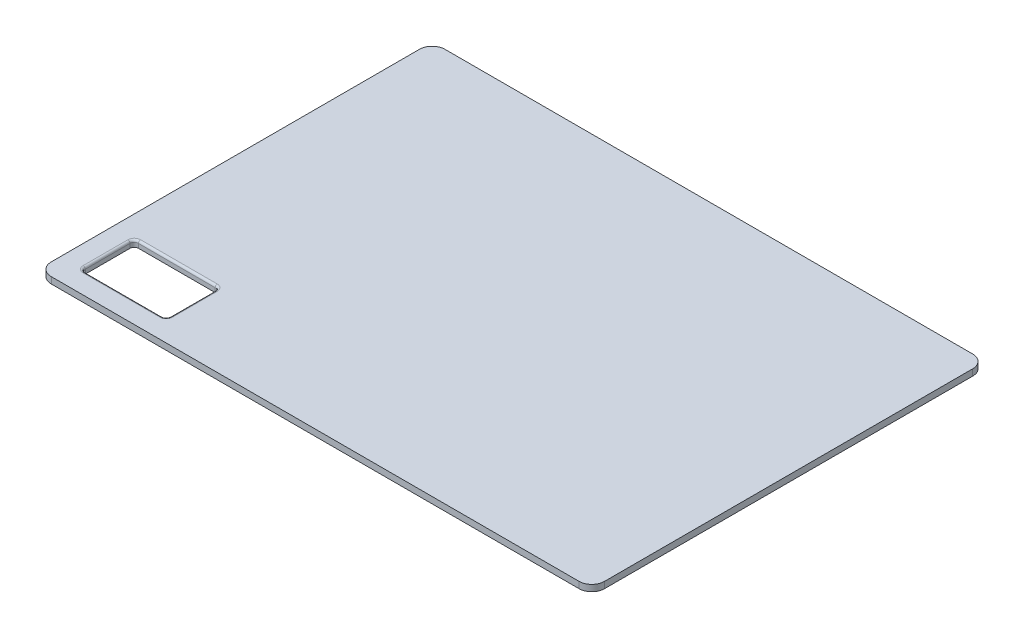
ISO-10303-21;
HEADER;
FILE_DESCRIPTION(('STEP AP214'),'2;1');
FILE_NAME('part.step','',(''),(''),'','','');
FILE_SCHEMA(('AUTOMOTIVE_DESIGN { 1 0 10303 214 1 1 1 1 }'));
ENDSEC;
DATA;
#1=APPLICATION_CONTEXT('core data for automotive mechanical design processes');
#2=APPLICATION_PROTOCOL_DEFINITION('international standard','automotive_design',2000,#1);
#3=PRODUCT_CONTEXT('',#1,'mechanical');
#4=PRODUCT('Part','Part','',(#3));
#5=PRODUCT_RELATED_PRODUCT_CATEGORY('part','',(#4));
#6=PRODUCT_DEFINITION_FORMATION('','',#4);
#7=PRODUCT_DEFINITION_CONTEXT('part definition',#1,'design');
#8=PRODUCT_DEFINITION('design','',#6,#7);
#9=PRODUCT_DEFINITION_SHAPE('','',#8);
#10=(LENGTH_UNIT() NAMED_UNIT(*) SI_UNIT(.MILLI.,.METRE.));
#11=(NAMED_UNIT(*) PLANE_ANGLE_UNIT() SI_UNIT($,.RADIAN.));
#12=(NAMED_UNIT(*) SI_UNIT($,.STERADIAN.) SOLID_ANGLE_UNIT());
#13=UNCERTAINTY_MEASURE_WITH_UNIT(LENGTH_MEASURE(1.E-05),#10,'distance_accuracy_value','');
#14=(GEOMETRIC_REPRESENTATION_CONTEXT(3) GLOBAL_UNCERTAINTY_ASSIGNED_CONTEXT((#13)) GLOBAL_UNIT_ASSIGNED_CONTEXT((#10,
#11,#12)) REPRESENTATION_CONTEXT('',''));
#15=CARTESIAN_POINT('',(0.,0.,0.));
#16=DIRECTION('',(0.,0.,1.));
#17=DIRECTION('',(1.,0.,0.));
#18=AXIS2_PLACEMENT_3D('',#15,#16,#17);
#19=CARTESIAN_POINT('',(0.,3.,0.));
#20=DIRECTION('',(1.,0.,0.));
#21=DIRECTION('',(0.,0.,-1.));
#22=AXIS2_PLACEMENT_3D('',#19,#20,#21);
#23=PLANE('',#22);
#24=DIRECTION('',(0.,0.,1.));
#25=VECTOR('',#24,1.);
#26=CARTESIAN_POINT('',(0.,3.,0.));
#27=LINE('',#26,#25);
#28=CARTESIAN_POINT('',(0.,3.,-179.));
#29=VERTEX_POINT('',#28);
#30=CARTESIAN_POINT('',(0.,3.,-6.));
#31=VERTEX_POINT('',#30);
#32=EDGE_CURVE('E197',#29,#31,#27,.T.);
#33=ORIENTED_EDGE('',*,*,#32,.F.);
#34=DIRECTION('',(0.,-1.,0.));
#35=VECTOR('',#34,1.);
#36=CARTESIAN_POINT('',(0.,3.,-179.));
#37=LINE('',#36,#35);
#38=CARTESIAN_POINT('',(0.,0.,-179.));
#39=VERTEX_POINT('',#38);
#40=EDGE_CURVE('E182',#29,#39,#37,.T.);
#41=ORIENTED_EDGE('',*,*,#40,.T.);
#42=DIRECTION('',(0.,0.,1.));
#43=VECTOR('',#42,1.);
#44=CARTESIAN_POINT('',(0.,0.,0.));
#45=LINE('',#44,#43);
#46=CARTESIAN_POINT('',(0.,0.,-6.));
#47=VERTEX_POINT('',#46);
#48=EDGE_CURVE('E193',#39,#47,#45,.T.);
#49=ORIENTED_EDGE('',*,*,#48,.T.);
#50=DIRECTION('',(0.,-1.,0.));
#51=VECTOR('',#50,1.);
#52=CARTESIAN_POINT('',(0.,3.,-6.));
#53=LINE('',#52,#51);
#54=EDGE_CURVE('E199',#47,#31,#53,.F.);
#55=ORIENTED_EDGE('',*,*,#54,.T.);
#56=EDGE_LOOP('',(#33,#41,#49,#55));
#57=FACE_BOUND('',#56,.T.);
#58=ADVANCED_FACE('F41',(#57),#23,.F.);
#59=CARTESIAN_POINT('',(0.,3.,0.));
#60=DIRECTION('',(0.,0.,-1.));
#61=DIRECTION('',(-1.,0.,0.));
#62=AXIS2_PLACEMENT_3D('',#59,#60,#61);
#63=PLANE('',#62);
#64=DIRECTION('',(1.,0.,0.));
#65=VECTOR('',#64,1.);
#66=CARTESIAN_POINT('',(0.,0.,0.));
#67=LINE('',#66,#65);
#68=CARTESIAN_POINT('',(6.,0.,0.));
#69=VERTEX_POINT('',#68);
#70=CARTESIAN_POINT('',(254.,0.,0.));
#71=VERTEX_POINT('',#70);
#72=EDGE_CURVE('E204',#69,#71,#67,.T.);
#73=ORIENTED_EDGE('',*,*,#72,.T.);
#74=DIRECTION('',(0.,-1.,0.));
#75=VECTOR('',#74,1.);
#76=CARTESIAN_POINT('',(254.,3.,0.));
#77=LINE('',#76,#75);
#78=CARTESIAN_POINT('',(254.,3.,0.));
#79=VERTEX_POINT('',#78);
#80=EDGE_CURVE('E244',#71,#79,#77,.F.);
#81=ORIENTED_EDGE('',*,*,#80,.T.);
#82=DIRECTION('',(1.,0.,0.));
#83=VECTOR('',#82,1.);
#84=CARTESIAN_POINT('',(0.,3.,0.));
#85=LINE('',#84,#83);
#86=CARTESIAN_POINT('',(6.,3.,0.));
#87=VERTEX_POINT('',#86);
#88=EDGE_CURVE('E345',#87,#79,#85,.T.);
#89=ORIENTED_EDGE('',*,*,#88,.F.);
#90=DIRECTION('',(0.,-1.,0.));
#91=VECTOR('',#90,1.);
#92=CARTESIAN_POINT('',(6.,3.,0.));
#93=LINE('',#92,#91);
#94=EDGE_CURVE('E245',#87,#69,#93,.T.);
#95=ORIENTED_EDGE('',*,*,#94,.T.);
#96=EDGE_LOOP('',(#73,#81,#89,#95));
#97=FACE_BOUND('',#96,.T.);
#98=ADVANCED_FACE('F368',(#97),#63,.F.);
#99=CARTESIAN_POINT('',(260.,3.,0.));
#100=DIRECTION('',(-1.,0.,0.));
#101=DIRECTION('',(0.,0.,1.));
#102=AXIS2_PLACEMENT_3D('',#99,#100,#101);
#103=PLANE('',#102);
#104=DIRECTION('',(0.,0.,-1.));
#105=VECTOR('',#104,1.);
#106=CARTESIAN_POINT('',(260.,0.,0.));
#107=LINE('',#106,#105);
#108=CARTESIAN_POINT('',(260.,0.,-6.));
#109=VERTEX_POINT('',#108);
#110=CARTESIAN_POINT('',(260.,0.,-179.));
#111=VERTEX_POINT('',#110);
#112=EDGE_CURVE('E206',#109,#111,#107,.T.);
#113=ORIENTED_EDGE('',*,*,#112,.T.);
#114=DIRECTION('',(0.,-1.,0.));
#115=VECTOR('',#114,1.);
#116=CARTESIAN_POINT('',(260.,3.,-179.));
#117=LINE('',#116,#115);
#118=CARTESIAN_POINT('',(260.,3.,-179.));
#119=VERTEX_POINT('',#118);
#120=EDGE_CURVE('E239',#111,#119,#117,.F.);
#121=ORIENTED_EDGE('',*,*,#120,.T.);
#122=DIRECTION('',(0.,0.,-1.));
#123=VECTOR('',#122,1.);
#124=CARTESIAN_POINT('',(260.,3.,0.));
#125=LINE('',#124,#123);
#126=CARTESIAN_POINT('',(260.,3.,-6.));
#127=VERTEX_POINT('',#126);
#128=EDGE_CURVE('E343',#127,#119,#125,.T.);
#129=ORIENTED_EDGE('',*,*,#128,.F.);
#130=DIRECTION('',(0.,-1.,0.));
#131=VECTOR('',#130,1.);
#132=CARTESIAN_POINT('',(260.,3.,-6.));
#133=LINE('',#132,#131);
#134=EDGE_CURVE('E240',#127,#109,#133,.T.);
#135=ORIENTED_EDGE('',*,*,#134,.T.);
#136=EDGE_LOOP('',(#113,#121,#129,#135));
#137=FACE_BOUND('',#136,.T.);
#138=ADVANCED_FACE('F363',(#137),#103,.F.);
#139=CARTESIAN_POINT('',(0.,3.,-185.));
#140=DIRECTION('',(0.,0.,1.));
#141=DIRECTION('',(1.,0.,0.));
#142=AXIS2_PLACEMENT_3D('',#139,#140,#141);
#143=PLANE('',#142);
#144=DIRECTION('',(-1.,0.,0.));
#145=VECTOR('',#144,1.);
#146=CARTESIAN_POINT('',(0.,0.,-185.));
#147=LINE('',#146,#145);
#148=CARTESIAN_POINT('',(254.,0.,-185.));
#149=VERTEX_POINT('',#148);
#150=CARTESIAN_POINT('',(6.,0.,-185.));
#151=VERTEX_POINT('',#150);
#152=EDGE_CURVE('E218',#149,#151,#147,.T.);
#153=ORIENTED_EDGE('',*,*,#152,.T.);
#154=DIRECTION('',(0.,-1.,0.));
#155=VECTOR('',#154,1.);
#156=CARTESIAN_POINT('',(6.,3.,-185.));
#157=LINE('',#156,#155);
#158=CARTESIAN_POINT('',(6.,3.,-185.));
#159=VERTEX_POINT('',#158);
#160=EDGE_CURVE('E183',#151,#159,#157,.F.);
#161=ORIENTED_EDGE('',*,*,#160,.T.);
#162=DIRECTION('',(-1.,0.,0.));
#163=VECTOR('',#162,1.);
#164=CARTESIAN_POINT('',(0.,3.,-185.));
#165=LINE('',#164,#163);
#166=CARTESIAN_POINT('',(254.,3.,-185.));
#167=VERTEX_POINT('',#166);
#168=EDGE_CURVE('E211',#167,#159,#165,.T.);
#169=ORIENTED_EDGE('',*,*,#168,.F.);
#170=DIRECTION('',(0.,-1.,0.));
#171=VECTOR('',#170,1.);
#172=CARTESIAN_POINT('',(254.,3.,-185.));
#173=LINE('',#172,#171);
#174=EDGE_CURVE('E186',#167,#149,#173,.T.);
#175=ORIENTED_EDGE('',*,*,#174,.T.);
#176=EDGE_LOOP('',(#153,#161,#169,#175));
#177=FACE_BOUND('',#176,.T.);
#178=ADVANCED_FACE('F353',(#177),#143,.F.);
#179=CARTESIAN_POINT('',(0.,3.,-185.));
#180=DIRECTION('',(0.,-1.,0.));
#181=DIRECTION('',(0.,0.,-1.));
#182=AXIS2_PLACEMENT_3D('',#179,#180,#181);
#183=PLANE('',#182);
#184=DIRECTION('',(1.,0.,0.));
#185=VECTOR('',#184,1.);
#186=CARTESIAN_POINT('',(0.,3.,-9.00000000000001));
#187=LINE('',#186,#185);
#188=CARTESIAN_POINT('',(48.,3.,-9.00000000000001));
#189=VERTEX_POINT('',#188);
#190=CARTESIAN_POINT('',(12.,3.,-9.));
#191=VERTEX_POINT('',#190);
#192=EDGE_CURVE('E271',#189,#191,#187,.F.);
#193=ORIENTED_EDGE('',*,*,#192,.T.);
#194=CARTESIAN_POINT('',(12.,3.,-12.));
#195=DIRECTION('',(0.,-1.,0.));
#196=DIRECTION('',(0.,0.,-1.));
#197=AXIS2_PLACEMENT_3D('',#194,#195,#196);
#198=CIRCLE('',#197,3.);
#199=CARTESIAN_POINT('',(9.,3.,-12.));
#200=VERTEX_POINT('',#199);
#201=EDGE_CURVE('E290',#191,#200,#198,.T.);
#202=ORIENTED_EDGE('',*,*,#201,.T.);
#203=DIRECTION('',(0.,0.,1.));
#204=VECTOR('',#203,1.);
#205=CARTESIAN_POINT('',(8.99999999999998,3.,-185.));
#206=LINE('',#205,#204);
#207=CARTESIAN_POINT('',(9.,3.,-33.));
#208=VERTEX_POINT('',#207);
#209=EDGE_CURVE('E284',#200,#208,#206,.F.);
#210=ORIENTED_EDGE('',*,*,#209,.T.);
#211=CARTESIAN_POINT('',(12.,3.,-33.));
#212=DIRECTION('',(0.,-1.,0.));
#213=DIRECTION('',(0.,0.,-1.));
#214=AXIS2_PLACEMENT_3D('',#211,#212,#213);
#215=CIRCLE('',#214,3.);
#216=CARTESIAN_POINT('',(12.,3.,-36.));
#217=VERTEX_POINT('',#216);
#218=EDGE_CURVE('E282',#208,#217,#215,.T.);
#219=ORIENTED_EDGE('',*,*,#218,.T.);
#220=DIRECTION('',(-1.,0.,0.));
#221=VECTOR('',#220,1.);
#222=CARTESIAN_POINT('',(0.,3.,-36.));
#223=LINE('',#222,#221);
#224=CARTESIAN_POINT('',(48.,3.,-36.));
#225=VERTEX_POINT('',#224);
#226=EDGE_CURVE('E281',#217,#225,#223,.F.);
#227=ORIENTED_EDGE('',*,*,#226,.T.);
#228=CARTESIAN_POINT('',(48.,3.,-33.));
#229=DIRECTION('',(0.,-1.,0.));
#230=DIRECTION('',(0.,0.,-1.));
#231=AXIS2_PLACEMENT_3D('',#228,#229,#230);
#232=CIRCLE('',#231,3.);
#233=CARTESIAN_POINT('',(51.,3.,-33.));
#234=VERTEX_POINT('',#233);
#235=EDGE_CURVE('E276',#225,#234,#232,.T.);
#236=ORIENTED_EDGE('',*,*,#235,.T.);
#237=DIRECTION('',(0.,0.,-1.));
#238=VECTOR('',#237,1.);
#239=CARTESIAN_POINT('',(51.,3.,-185.));
#240=LINE('',#239,#238);
#241=CARTESIAN_POINT('',(51.,3.,-12.));
#242=VERTEX_POINT('',#241);
#243=EDGE_CURVE('E279',#234,#242,#240,.F.);
#244=ORIENTED_EDGE('',*,*,#243,.T.);
#245=CARTESIAN_POINT('',(48.,3.,-12.));
#246=DIRECTION('',(0.,-1.,0.));
#247=DIRECTION('',(0.,0.,-1.));
#248=AXIS2_PLACEMENT_3D('',#245,#246,#247);
#249=CIRCLE('',#248,3.);
#250=EDGE_CURVE('E273',#242,#189,#249,.T.);
#251=ORIENTED_EDGE('',*,*,#250,.T.);
#252=EDGE_LOOP('',(#193,#202,#210,#219,#227,#236,#244,#251));
#253=FACE_BOUND('',#252,.T.);
#254=ORIENTED_EDGE('',*,*,#168,.T.);
#255=CARTESIAN_POINT('',(6.,3.,-179.));
#256=DIRECTION('',(0.,-1.,0.));
#257=DIRECTION('',(0.,0.,-1.));
#258=AXIS2_PLACEMENT_3D('',#255,#256,#257);
#259=CIRCLE('',#258,6.);
#260=EDGE_CURVE('E232',#159,#29,#259,.F.);
#261=ORIENTED_EDGE('',*,*,#260,.T.);
#262=ORIENTED_EDGE('',*,*,#32,.T.);
#263=CARTESIAN_POINT('',(6.,3.,-6.));
#264=DIRECTION('',(0.,-1.,0.));
#265=DIRECTION('',(0.,0.,-1.));
#266=AXIS2_PLACEMENT_3D('',#263,#264,#265);
#267=CIRCLE('',#266,6.);
#268=EDGE_CURVE('E230',#31,#87,#267,.F.);
#269=ORIENTED_EDGE('',*,*,#268,.T.);
#270=ORIENTED_EDGE('',*,*,#88,.T.);
#271=CARTESIAN_POINT('',(254.,3.,-6.));
#272=DIRECTION('',(0.,-1.,0.));
#273=DIRECTION('',(0.,0.,-1.));
#274=AXIS2_PLACEMENT_3D('',#271,#272,#273);
#275=CIRCLE('',#274,6.);
#276=EDGE_CURVE('E233',#79,#127,#275,.F.);
#277=ORIENTED_EDGE('',*,*,#276,.T.);
#278=ORIENTED_EDGE('',*,*,#128,.T.);
#279=CARTESIAN_POINT('',(254.,3.,-179.));
#280=DIRECTION('',(0.,-1.,0.));
#281=DIRECTION('',(0.,0.,-1.));
#282=AXIS2_PLACEMENT_3D('',#279,#280,#281);
#283=CIRCLE('',#282,6.);
#284=EDGE_CURVE('E231',#119,#167,#283,.F.);
#285=ORIENTED_EDGE('',*,*,#284,.T.);
#286=EDGE_LOOP('',(#254,#261,#262,#269,#270,#277,#278,#285));
#287=FACE_BOUND('',#286,.T.);
#288=ADVANCED_FACE('F355',(#253,#287),#183,.F.);
#289=CARTESIAN_POINT('',(0.,0.,-185.));
#290=DIRECTION('',(0.,-1.,0.));
#291=DIRECTION('',(0.,0.,-1.));
#292=AXIS2_PLACEMENT_3D('',#289,#290,#291);
#293=PLANE('',#292);
#294=DIRECTION('',(-1.,0.,0.));
#295=VECTOR('',#294,1.);
#296=CARTESIAN_POINT('',(10.,0.,-35.));
#297=LINE('',#296,#295);
#298=CARTESIAN_POINT('',(48.,0.,-35.));
#299=VERTEX_POINT('',#298);
#300=CARTESIAN_POINT('',(12.,0.,-35.));
#301=VERTEX_POINT('',#300);
#302=EDGE_CURVE('E201',#299,#301,#297,.T.);
#303=ORIENTED_EDGE('',*,*,#302,.T.);
#304=CARTESIAN_POINT('',(12.,0.,-33.));
#305=DIRECTION('',(0.,-1.,0.));
#306=DIRECTION('',(0.,0.,-1.));
#307=AXIS2_PLACEMENT_3D('',#304,#305,#306);
#308=CIRCLE('',#307,2.);
#309=CARTESIAN_POINT('',(10.,0.,-33.));
#310=VERTEX_POINT('',#309);
#311=EDGE_CURVE('E272',#301,#310,#308,.F.);
#312=ORIENTED_EDGE('',*,*,#311,.T.);
#313=DIRECTION('',(0.,0.,1.));
#314=VECTOR('',#313,1.);
#315=CARTESIAN_POINT('',(10.,0.,-10.));
#316=LINE('',#315,#314);
#317=CARTESIAN_POINT('',(10.,0.,-12.));
#318=VERTEX_POINT('',#317);
#319=EDGE_CURVE('E326',#310,#318,#316,.T.);
#320=ORIENTED_EDGE('',*,*,#319,.T.);
#321=CARTESIAN_POINT('',(12.,0.,-12.));
#322=DIRECTION('',(0.,-1.,0.));
#323=DIRECTION('',(0.,0.,-1.));
#324=AXIS2_PLACEMENT_3D('',#321,#322,#323);
#325=CIRCLE('',#324,2.);
#326=CARTESIAN_POINT('',(12.,0.,-10.));
#327=VERTEX_POINT('',#326);
#328=EDGE_CURVE('E269',#318,#327,#325,.F.);
#329=ORIENTED_EDGE('',*,*,#328,.T.);
#330=DIRECTION('',(1.,0.,0.));
#331=VECTOR('',#330,1.);
#332=CARTESIAN_POINT('',(10.,0.,-10.));
#333=LINE('',#332,#331);
#334=CARTESIAN_POINT('',(48.,0.,-10.));
#335=VERTEX_POINT('',#334);
#336=EDGE_CURVE('E335',#327,#335,#333,.T.);
#337=ORIENTED_EDGE('',*,*,#336,.T.);
#338=CARTESIAN_POINT('',(48.,0.,-12.));
#339=DIRECTION('',(0.,-1.,0.));
#340=DIRECTION('',(0.,0.,-1.));
#341=AXIS2_PLACEMENT_3D('',#338,#339,#340);
#342=CIRCLE('',#341,2.);
#343=CARTESIAN_POINT('',(50.,0.,-12.));
#344=VERTEX_POINT('',#343);
#345=EDGE_CURVE('E270',#335,#344,#342,.F.);
#346=ORIENTED_EDGE('',*,*,#345,.T.);
#347=DIRECTION('',(0.,0.,-1.));
#348=VECTOR('',#347,1.);
#349=CARTESIAN_POINT('',(50.,0.,-10.));
#350=LINE('',#349,#348);
#351=CARTESIAN_POINT('',(50.,0.,-33.));
#352=VERTEX_POINT('',#351);
#353=EDGE_CURVE('E212',#344,#352,#350,.T.);
#354=ORIENTED_EDGE('',*,*,#353,.T.);
#355=CARTESIAN_POINT('',(48.,0.,-33.));
#356=DIRECTION('',(0.,-1.,0.));
#357=DIRECTION('',(0.,0.,-1.));
#358=AXIS2_PLACEMENT_3D('',#355,#356,#357);
#359=CIRCLE('',#358,2.);
#360=EDGE_CURVE('E264',#352,#299,#359,.F.);
#361=ORIENTED_EDGE('',*,*,#360,.T.);
#362=EDGE_LOOP('',(#303,#312,#320,#329,#337,#346,#354,#361));
#363=FACE_BOUND('',#362,.T.);
#364=ORIENTED_EDGE('',*,*,#48,.F.);
#365=CARTESIAN_POINT('',(6.,0.,-179.));
#366=DIRECTION('',(0.,-1.,0.));
#367=DIRECTION('',(0.,0.,-1.));
#368=AXIS2_PLACEMENT_3D('',#365,#366,#367);
#369=CIRCLE('',#368,6.);
#370=EDGE_CURVE('E177',#39,#151,#369,.T.);
#371=ORIENTED_EDGE('',*,*,#370,.T.);
#372=ORIENTED_EDGE('',*,*,#152,.F.);
#373=CARTESIAN_POINT('',(254.,0.,-179.));
#374=DIRECTION('',(0.,-1.,0.));
#375=DIRECTION('',(0.,0.,-1.));
#376=AXIS2_PLACEMENT_3D('',#373,#374,#375);
#377=CIRCLE('',#376,6.);
#378=EDGE_CURVE('E188',#149,#111,#377,.T.);
#379=ORIENTED_EDGE('',*,*,#378,.T.);
#380=ORIENTED_EDGE('',*,*,#112,.F.);
#381=CARTESIAN_POINT('',(254.,0.,-6.));
#382=DIRECTION('',(0.,-1.,0.));
#383=DIRECTION('',(0.,0.,-1.));
#384=AXIS2_PLACEMENT_3D('',#381,#382,#383);
#385=CIRCLE('',#384,6.);
#386=EDGE_CURVE('E224',#109,#71,#385,.T.);
#387=ORIENTED_EDGE('',*,*,#386,.T.);
#388=ORIENTED_EDGE('',*,*,#72,.F.);
#389=CARTESIAN_POINT('',(6.,0.,-6.));
#390=DIRECTION('',(0.,-1.,0.));
#391=DIRECTION('',(0.,0.,-1.));
#392=AXIS2_PLACEMENT_3D('',#389,#390,#391);
#393=CIRCLE('',#392,6.);
#394=EDGE_CURVE('E198',#69,#47,#393,.T.);
#395=ORIENTED_EDGE('',*,*,#394,.T.);
#396=EDGE_LOOP('',(#364,#371,#372,#379,#380,#387,#388,#395));
#397=FACE_BOUND('',#396,.T.);
#398=ADVANCED_FACE('F205',(#363,#397),#293,.T.);
#399=CARTESIAN_POINT('',(6.,3.,-179.));
#400=DIRECTION('',(0.,-1.,0.));
#401=DIRECTION('',(0.,0.,-1.));
#402=AXIS2_PLACEMENT_3D('',#399,#400,#401);
#403=CYLINDRICAL_SURFACE('',#402,6.);
#404=ORIENTED_EDGE('',*,*,#260,.F.);
#405=ORIENTED_EDGE('',*,*,#160,.F.);
#406=ORIENTED_EDGE('',*,*,#370,.F.);
#407=ORIENTED_EDGE('',*,*,#40,.F.);
#408=EDGE_LOOP('',(#404,#405,#406,#407));
#409=FACE_BOUND('',#408,.T.);
#410=ADVANCED_FACE('F185',(#409),#403,.T.);
#411=CARTESIAN_POINT('',(254.,3.,-179.));
#412=DIRECTION('',(0.,-1.,0.));
#413=DIRECTION('',(0.,0.,-1.));
#414=AXIS2_PLACEMENT_3D('',#411,#412,#413);
#415=CYLINDRICAL_SURFACE('',#414,6.);
#416=ORIENTED_EDGE('',*,*,#284,.F.);
#417=ORIENTED_EDGE('',*,*,#120,.F.);
#418=ORIENTED_EDGE('',*,*,#378,.F.);
#419=ORIENTED_EDGE('',*,*,#174,.F.);
#420=EDGE_LOOP('',(#416,#417,#418,#419));
#421=FACE_BOUND('',#420,.T.);
#422=ADVANCED_FACE('F357',(#421),#415,.T.);
#423=CARTESIAN_POINT('',(254.,3.,-6.));
#424=DIRECTION('',(0.,-1.,0.));
#425=DIRECTION('',(0.,0.,-1.));
#426=AXIS2_PLACEMENT_3D('',#423,#424,#425);
#427=CYLINDRICAL_SURFACE('',#426,6.);
#428=ORIENTED_EDGE('',*,*,#276,.F.);
#429=ORIENTED_EDGE('',*,*,#80,.F.);
#430=ORIENTED_EDGE('',*,*,#386,.F.);
#431=ORIENTED_EDGE('',*,*,#134,.F.);
#432=EDGE_LOOP('',(#428,#429,#430,#431));
#433=FACE_BOUND('',#432,.T.);
#434=ADVANCED_FACE('F362',(#433),#427,.T.);
#435=CARTESIAN_POINT('',(6.,3.,-6.));
#436=DIRECTION('',(0.,-1.,0.));
#437=DIRECTION('',(0.,0.,-1.));
#438=AXIS2_PLACEMENT_3D('',#435,#436,#437);
#439=CYLINDRICAL_SURFACE('',#438,6.);
#440=ORIENTED_EDGE('',*,*,#268,.F.);
#441=ORIENTED_EDGE('',*,*,#54,.F.);
#442=ORIENTED_EDGE('',*,*,#394,.F.);
#443=ORIENTED_EDGE('',*,*,#94,.F.);
#444=EDGE_LOOP('',(#440,#441,#442,#443));
#445=FACE_BOUND('',#444,.T.);
#446=ADVANCED_FACE('F373',(#445),#439,.T.);
#447=CARTESIAN_POINT('',(10.,0.,-10.));
#448=DIRECTION('',(-1.,0.,0.));
#449=DIRECTION('',(0.,0.,1.));
#450=AXIS2_PLACEMENT_3D('',#447,#448,#449);
#451=PLANE('',#450);
#452=DIRECTION('',(0.,1.,0.));
#453=VECTOR('',#452,1.);
#454=CARTESIAN_POINT('',(10.,3.,-33.));
#455=LINE('',#454,#453);
#456=CARTESIAN_POINT('',(10.,2.,-33.));
#457=VERTEX_POINT('',#456);
#458=EDGE_CURVE('E258',#310,#457,#455,.T.);
#459=ORIENTED_EDGE('',*,*,#458,.T.);
#460=DIRECTION('',(0.,0.,1.));
#461=VECTOR('',#460,1.);
#462=CARTESIAN_POINT('',(10.,2.,-10.));
#463=LINE('',#462,#461);
#464=CARTESIAN_POINT('',(10.,2.,-12.));
#465=VERTEX_POINT('',#464);
#466=EDGE_CURVE('E291',#457,#465,#463,.T.);
#467=ORIENTED_EDGE('',*,*,#466,.T.);
#468=DIRECTION('',(0.,1.,0.));
#469=VECTOR('',#468,1.);
#470=CARTESIAN_POINT('',(10.,0.,-12.));
#471=LINE('',#470,#469);
#472=EDGE_CURVE('E262',#465,#318,#471,.F.);
#473=ORIENTED_EDGE('',*,*,#472,.T.);
#474=ORIENTED_EDGE('',*,*,#319,.F.);
#475=EDGE_LOOP('',(#459,#467,#473,#474));
#476=FACE_BOUND('',#475,.T.);
#477=ADVANCED_FACE('F374',(#476),#451,.F.);
#478=CARTESIAN_POINT('',(10.,0.,-35.));
#479=DIRECTION('',(0.,0.,-1.));
#480=DIRECTION('',(-1.,0.,0.));
#481=AXIS2_PLACEMENT_3D('',#478,#479,#480);
#482=PLANE('',#481);
#483=DIRECTION('',(0.,1.,0.));
#484=VECTOR('',#483,1.);
#485=CARTESIAN_POINT('',(48.,3.,-35.));
#486=LINE('',#485,#484);
#487=CARTESIAN_POINT('',(48.,2.,-35.));
#488=VERTEX_POINT('',#487);
#489=EDGE_CURVE('E248',#299,#488,#486,.T.);
#490=ORIENTED_EDGE('',*,*,#489,.T.);
#491=DIRECTION('',(-1.,0.,0.));
#492=VECTOR('',#491,1.);
#493=CARTESIAN_POINT('',(10.,2.,-35.));
#494=LINE('',#493,#492);
#495=CARTESIAN_POINT('',(12.,2.,-35.));
#496=VERTEX_POINT('',#495);
#497=EDGE_CURVE('E300',#488,#496,#494,.T.);
#498=ORIENTED_EDGE('',*,*,#497,.T.);
#499=DIRECTION('',(0.,1.,0.));
#500=VECTOR('',#499,1.);
#501=CARTESIAN_POINT('',(12.,0.,-35.));
#502=LINE('',#501,#500);
#503=EDGE_CURVE('E250',#496,#301,#502,.F.);
#504=ORIENTED_EDGE('',*,*,#503,.T.);
#505=ORIENTED_EDGE('',*,*,#302,.F.);
#506=EDGE_LOOP('',(#490,#498,#504,#505));
#507=FACE_BOUND('',#506,.T.);
#508=ADVANCED_FACE('F385',(#507),#482,.F.);
#509=CARTESIAN_POINT('',(50.,0.,-10.));
#510=DIRECTION('',(1.,0.,0.));
#511=DIRECTION('',(0.,0.,-1.));
#512=AXIS2_PLACEMENT_3D('',#509,#510,#511);
#513=PLANE('',#512);
#514=DIRECTION('',(0.,1.,0.));
#515=VECTOR('',#514,1.);
#516=CARTESIAN_POINT('',(50.,3.,-12.));
#517=LINE('',#516,#515);
#518=CARTESIAN_POINT('',(50.,2.,-12.));
#519=VERTEX_POINT('',#518);
#520=EDGE_CURVE('E255',#344,#519,#517,.T.);
#521=ORIENTED_EDGE('',*,*,#520,.T.);
#522=DIRECTION('',(0.,0.,-1.));
#523=VECTOR('',#522,1.);
#524=CARTESIAN_POINT('',(50.,2.,-10.));
#525=LINE('',#524,#523);
#526=CARTESIAN_POINT('',(50.,2.,-33.));
#527=VERTEX_POINT('',#526);
#528=EDGE_CURVE('E301',#519,#527,#525,.T.);
#529=ORIENTED_EDGE('',*,*,#528,.T.);
#530=DIRECTION('',(0.,1.,0.));
#531=VECTOR('',#530,1.);
#532=CARTESIAN_POINT('',(50.,0.,-33.));
#533=LINE('',#532,#531);
#534=EDGE_CURVE('E251',#527,#352,#533,.F.);
#535=ORIENTED_EDGE('',*,*,#534,.T.);
#536=ORIENTED_EDGE('',*,*,#353,.F.);
#537=EDGE_LOOP('',(#521,#529,#535,#536));
#538=FACE_BOUND('',#537,.T.);
#539=ADVANCED_FACE('F423',(#538),#513,.F.);
#540=CARTESIAN_POINT('',(10.,0.,-10.));
#541=DIRECTION('',(0.,0.,1.));
#542=DIRECTION('',(1.,0.,0.));
#543=AXIS2_PLACEMENT_3D('',#540,#541,#542);
#544=PLANE('',#543);
#545=DIRECTION('',(0.,1.,0.));
#546=VECTOR('',#545,1.);
#547=CARTESIAN_POINT('',(12.,3.,-10.));
#548=LINE('',#547,#546);
#549=CARTESIAN_POINT('',(12.,2.,-10.));
#550=VERTEX_POINT('',#549);
#551=EDGE_CURVE('E257',#327,#550,#548,.T.);
#552=ORIENTED_EDGE('',*,*,#551,.T.);
#553=DIRECTION('',(1.,0.,0.));
#554=VECTOR('',#553,1.);
#555=CARTESIAN_POINT('',(10.,2.,-10.));
#556=LINE('',#555,#554);
#557=CARTESIAN_POINT('',(48.,2.,-10.));
#558=VERTEX_POINT('',#557);
#559=EDGE_CURVE('E11',#550,#558,#556,.T.);
#560=ORIENTED_EDGE('',*,*,#559,.T.);
#561=DIRECTION('',(0.,1.,0.));
#562=VECTOR('',#561,1.);
#563=CARTESIAN_POINT('',(48.,0.,-10.));
#564=LINE('',#563,#562);
#565=EDGE_CURVE('E260',#558,#335,#564,.F.);
#566=ORIENTED_EDGE('',*,*,#565,.T.);
#567=ORIENTED_EDGE('',*,*,#336,.F.);
#568=EDGE_LOOP('',(#552,#560,#566,#567));
#569=FACE_BOUND('',#568,.T.);
#570=ADVANCED_FACE('F429',(#569),#544,.F.);
#571=CARTESIAN_POINT('',(48.,0.,-33.));
#572=DIRECTION('',(0.,-1.,0.));
#573=DIRECTION('',(0.,0.,-1.));
#574=AXIS2_PLACEMENT_3D('',#571,#572,#573);
#575=CYLINDRICAL_SURFACE('',#574,2.);
#576=ORIENTED_EDGE('',*,*,#534,.F.);
#577=CARTESIAN_POINT('',(48.,2.,-33.));
#578=DIRECTION('',(0.,-1.,0.));
#579=DIRECTION('',(0.,0.,-1.));
#580=AXIS2_PLACEMENT_3D('',#577,#578,#579);
#581=CIRCLE('',#580,2.);
#582=EDGE_CURVE('E299',#527,#488,#581,.F.);
#583=ORIENTED_EDGE('',*,*,#582,.T.);
#584=ORIENTED_EDGE('',*,*,#489,.F.);
#585=ORIENTED_EDGE('',*,*,#360,.F.);
#586=EDGE_LOOP('',(#576,#583,#584,#585));
#587=FACE_BOUND('',#586,.T.);
#588=ADVANCED_FACE('F440',(#587),#575,.F.);
#589=CARTESIAN_POINT('',(48.,0.,-12.));
#590=DIRECTION('',(0.,-1.,0.));
#591=DIRECTION('',(0.,0.,-1.));
#592=AXIS2_PLACEMENT_3D('',#589,#590,#591);
#593=CYLINDRICAL_SURFACE('',#592,2.);
#594=ORIENTED_EDGE('',*,*,#565,.F.);
#595=CARTESIAN_POINT('',(48.,2.,-12.));
#596=DIRECTION('',(0.,-1.,0.));
#597=DIRECTION('',(0.,0.,-1.));
#598=AXIS2_PLACEMENT_3D('',#595,#596,#597);
#599=CIRCLE('',#598,2.);
#600=EDGE_CURVE('E49',#558,#519,#599,.F.);
#601=ORIENTED_EDGE('',*,*,#600,.T.);
#602=ORIENTED_EDGE('',*,*,#520,.F.);
#603=ORIENTED_EDGE('',*,*,#345,.F.);
#604=EDGE_LOOP('',(#594,#601,#602,#603));
#605=FACE_BOUND('',#604,.T.);
#606=ADVANCED_FACE('F443',(#605),#593,.F.);
#607=CARTESIAN_POINT('',(12.,0.,-12.));
#608=DIRECTION('',(0.,-1.,0.));
#609=DIRECTION('',(0.,0.,-1.));
#610=AXIS2_PLACEMENT_3D('',#607,#608,#609);
#611=CYLINDRICAL_SURFACE('',#610,2.);
#612=ORIENTED_EDGE('',*,*,#472,.F.);
#613=CARTESIAN_POINT('',(12.,2.,-12.));
#614=DIRECTION('',(0.,-1.,0.));
#615=DIRECTION('',(0.,0.,-1.));
#616=AXIS2_PLACEMENT_3D('',#613,#614,#615);
#617=CIRCLE('',#616,2.);
#618=EDGE_CURVE('E288',#465,#550,#617,.F.);
#619=ORIENTED_EDGE('',*,*,#618,.T.);
#620=ORIENTED_EDGE('',*,*,#551,.F.);
#621=ORIENTED_EDGE('',*,*,#328,.F.);
#622=EDGE_LOOP('',(#612,#619,#620,#621));
#623=FACE_BOUND('',#622,.T.);
#624=ADVANCED_FACE('F452',(#623),#611,.F.);
#625=CARTESIAN_POINT('',(12.,0.,-33.));
#626=DIRECTION('',(0.,-1.,0.));
#627=DIRECTION('',(0.,0.,-1.));
#628=AXIS2_PLACEMENT_3D('',#625,#626,#627);
#629=CYLINDRICAL_SURFACE('',#628,2.);
#630=ORIENTED_EDGE('',*,*,#503,.F.);
#631=CARTESIAN_POINT('',(12.,2.,-33.));
#632=DIRECTION('',(0.,-1.,0.));
#633=DIRECTION('',(0.,0.,-1.));
#634=AXIS2_PLACEMENT_3D('',#631,#632,#633);
#635=CIRCLE('',#634,2.);
#636=EDGE_CURVE('E294',#496,#457,#635,.F.);
#637=ORIENTED_EDGE('',*,*,#636,.T.);
#638=ORIENTED_EDGE('',*,*,#458,.F.);
#639=ORIENTED_EDGE('',*,*,#311,.F.);
#640=EDGE_LOOP('',(#630,#637,#638,#639));
#641=FACE_BOUND('',#640,.T.);
#642=ADVANCED_FACE('F457',(#641),#629,.F.);
#643=CARTESIAN_POINT('',(48.,2.,-33.));
#644=DIRECTION('',(0.,-1.,0.));
#645=DIRECTION('',(0.,0.,-1.));
#646=AXIS2_PLACEMENT_3D('',#643,#644,#645);
#647=TOROIDAL_SURFACE('',#646,3.,1.);
#648=CARTESIAN_POINT('',(48.,2.,-36.));
#649=DIRECTION('',(-1.,0.,0.));
#650=DIRECTION('',(0.,0.,1.));
#651=AXIS2_PLACEMENT_3D('',#648,#649,#650);
#652=CIRCLE('',#651,1.);
#653=EDGE_CURVE('E316',#488,#225,#652,.T.);
#654=ORIENTED_EDGE('',*,*,#653,.F.);
#655=ORIENTED_EDGE('',*,*,#582,.F.);
#656=CARTESIAN_POINT('',(51.,2.,-33.));
#657=DIRECTION('',(0.,0.,1.));
#658=DIRECTION('',(1.,0.,0.));
#659=AXIS2_PLACEMENT_3D('',#656,#657,#658);
#660=CIRCLE('',#659,1.);
#661=EDGE_CURVE('E44',#234,#527,#660,.T.);
#662=ORIENTED_EDGE('',*,*,#661,.F.);
#663=ORIENTED_EDGE('',*,*,#235,.F.);
#664=EDGE_LOOP('',(#654,#655,#662,#663));
#665=FACE_BOUND('',#664,.T.);
#666=ADVANCED_FACE('F43',(#665),#647,.T.);
#667=CARTESIAN_POINT('',(51.,2.,-10.));
#668=DIRECTION('',(0.,0.,-1.));
#669=DIRECTION('',(-1.,0.,0.));
#670=AXIS2_PLACEMENT_3D('',#667,#668,#669);
#671=CYLINDRICAL_SURFACE('',#670,1.);
#672=ORIENTED_EDGE('',*,*,#661,.T.);
#673=ORIENTED_EDGE('',*,*,#528,.F.);
#674=CARTESIAN_POINT('',(51.,2.,-12.));
#675=DIRECTION('',(0.,0.,1.));
#676=DIRECTION('',(1.,0.,0.));
#677=AXIS2_PLACEMENT_3D('',#674,#675,#676);
#678=CIRCLE('',#677,1.);
#679=EDGE_CURVE('E320',#242,#519,#678,.T.);
#680=ORIENTED_EDGE('',*,*,#679,.F.);
#681=ORIENTED_EDGE('',*,*,#243,.F.);
#682=EDGE_LOOP('',(#672,#673,#680,#681));
#683=FACE_BOUND('',#682,.T.);
#684=ADVANCED_FACE('F471',(#683),#671,.T.);
#685=CARTESIAN_POINT('',(10.,2.,-36.));
#686=DIRECTION('',(-1.,0.,0.));
#687=DIRECTION('',(0.,0.,1.));
#688=AXIS2_PLACEMENT_3D('',#685,#686,#687);
#689=CYLINDRICAL_SURFACE('',#688,1.);
#690=ORIENTED_EDGE('',*,*,#653,.T.);
#691=ORIENTED_EDGE('',*,*,#226,.F.);
#692=CARTESIAN_POINT('',(12.,2.,-36.));
#693=DIRECTION('',(-1.,0.,0.));
#694=DIRECTION('',(0.,0.,1.));
#695=AXIS2_PLACEMENT_3D('',#692,#693,#694);
#696=CIRCLE('',#695,1.);
#697=EDGE_CURVE('E313',#496,#217,#696,.T.);
#698=ORIENTED_EDGE('',*,*,#697,.F.);
#699=ORIENTED_EDGE('',*,*,#497,.F.);
#700=EDGE_LOOP('',(#690,#691,#698,#699));
#701=FACE_BOUND('',#700,.T.);
#702=ADVANCED_FACE('F481',(#701),#689,.T.);
#703=CARTESIAN_POINT('',(48.,2.,-12.));
#704=DIRECTION('',(0.,-1.,0.));
#705=DIRECTION('',(0.,0.,-1.));
#706=AXIS2_PLACEMENT_3D('',#703,#704,#705);
#707=TOROIDAL_SURFACE('',#706,3.,1.);
#708=ORIENTED_EDGE('',*,*,#679,.T.);
#709=ORIENTED_EDGE('',*,*,#600,.F.);
#710=CARTESIAN_POINT('',(48.,2.,-9.00000000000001));
#711=DIRECTION('',(-1.,0.,0.));
#712=DIRECTION('',(0.,0.,1.));
#713=AXIS2_PLACEMENT_3D('',#710,#711,#712);
#714=CIRCLE('',#713,1.);
#715=EDGE_CURVE('E311',#189,#558,#714,.T.);
#716=ORIENTED_EDGE('',*,*,#715,.F.);
#717=ORIENTED_EDGE('',*,*,#250,.F.);
#718=EDGE_LOOP('',(#708,#709,#716,#717));
#719=FACE_BOUND('',#718,.T.);
#720=ADVANCED_FACE('F489',(#719),#707,.T.);
#721=CARTESIAN_POINT('',(12.,2.,-33.));
#722=DIRECTION('',(0.,-1.,0.));
#723=DIRECTION('',(0.,0.,-1.));
#724=AXIS2_PLACEMENT_3D('',#721,#722,#723);
#725=TOROIDAL_SURFACE('',#724,3.,1.);
#726=ORIENTED_EDGE('',*,*,#697,.T.);
#727=ORIENTED_EDGE('',*,*,#218,.F.);
#728=CARTESIAN_POINT('',(9.,2.,-33.));
#729=DIRECTION('',(0.,0.,1.));
#730=DIRECTION('',(1.,0.,0.));
#731=AXIS2_PLACEMENT_3D('',#728,#729,#730);
#732=CIRCLE('',#731,1.);
#733=EDGE_CURVE('E308',#457,#208,#732,.T.);
#734=ORIENTED_EDGE('',*,*,#733,.F.);
#735=ORIENTED_EDGE('',*,*,#636,.F.);
#736=EDGE_LOOP('',(#726,#727,#734,#735));
#737=FACE_BOUND('',#736,.T.);
#738=ADVANCED_FACE('F500',(#737),#725,.T.);
#739=CARTESIAN_POINT('',(10.,2.,-9.));
#740=DIRECTION('',(1.,0.,0.));
#741=DIRECTION('',(0.,0.,-1.));
#742=AXIS2_PLACEMENT_3D('',#739,#740,#741);
#743=CYLINDRICAL_SURFACE('',#742,1.);
#744=ORIENTED_EDGE('',*,*,#715,.T.);
#745=ORIENTED_EDGE('',*,*,#559,.F.);
#746=CARTESIAN_POINT('',(12.,2.,-9.));
#747=DIRECTION('',(-1.,0.,0.));
#748=DIRECTION('',(0.,0.,1.));
#749=AXIS2_PLACEMENT_3D('',#746,#747,#748);
#750=CIRCLE('',#749,1.);
#751=EDGE_CURVE('E306',#191,#550,#750,.T.);
#752=ORIENTED_EDGE('',*,*,#751,.F.);
#753=ORIENTED_EDGE('',*,*,#192,.F.);
#754=EDGE_LOOP('',(#744,#745,#752,#753));
#755=FACE_BOUND('',#754,.T.);
#756=ADVANCED_FACE('F506',(#755),#743,.T.);
#757=CARTESIAN_POINT('',(9.,2.,-10.));
#758=DIRECTION('',(0.,0.,1.));
#759=DIRECTION('',(1.,0.,0.));
#760=AXIS2_PLACEMENT_3D('',#757,#758,#759);
#761=CYLINDRICAL_SURFACE('',#760,1.);
#762=ORIENTED_EDGE('',*,*,#733,.T.);
#763=ORIENTED_EDGE('',*,*,#209,.F.);
#764=CARTESIAN_POINT('',(9.,2.,-12.));
#765=DIRECTION('',(0.,0.,1.));
#766=DIRECTION('',(1.,0.,0.));
#767=AXIS2_PLACEMENT_3D('',#764,#765,#766);
#768=CIRCLE('',#767,1.);
#769=EDGE_CURVE('E302',#465,#200,#768,.T.);
#770=ORIENTED_EDGE('',*,*,#769,.F.);
#771=ORIENTED_EDGE('',*,*,#466,.F.);
#772=EDGE_LOOP('',(#762,#763,#770,#771));
#773=FACE_BOUND('',#772,.T.);
#774=ADVANCED_FACE('F517',(#773),#761,.T.);
#775=CARTESIAN_POINT('',(12.,2.,-12.));
#776=DIRECTION('',(0.,-1.,0.));
#777=DIRECTION('',(0.,0.,-1.));
#778=AXIS2_PLACEMENT_3D('',#775,#776,#777);
#779=TOROIDAL_SURFACE('',#778,3.,1.);
#780=ORIENTED_EDGE('',*,*,#751,.T.);
#781=ORIENTED_EDGE('',*,*,#618,.F.);
#782=ORIENTED_EDGE('',*,*,#769,.T.);
#783=ORIENTED_EDGE('',*,*,#201,.F.);
#784=EDGE_LOOP('',(#780,#781,#782,#783));
#785=FACE_BOUND('',#784,.T.);
#786=ADVANCED_FACE('F523',(#785),#779,.T.);
#787=CLOSED_SHELL('',(#58,#98,#138,#178,#288,#398,#410,#422,#434,#446,#477,#508,#539,#570,#588,
#606,#624,#642,#666,#684,#702,#720,#738,#756,#774,#786));
#788=MANIFOLD_SOLID_BREP('B2',#787);
#789=ADVANCED_BREP_SHAPE_REPRESENTATION('',(#18,#788),#14);
#790=SHAPE_DEFINITION_REPRESENTATION(#9,#789);
ENDSEC;
END-ISO-10303-21;
